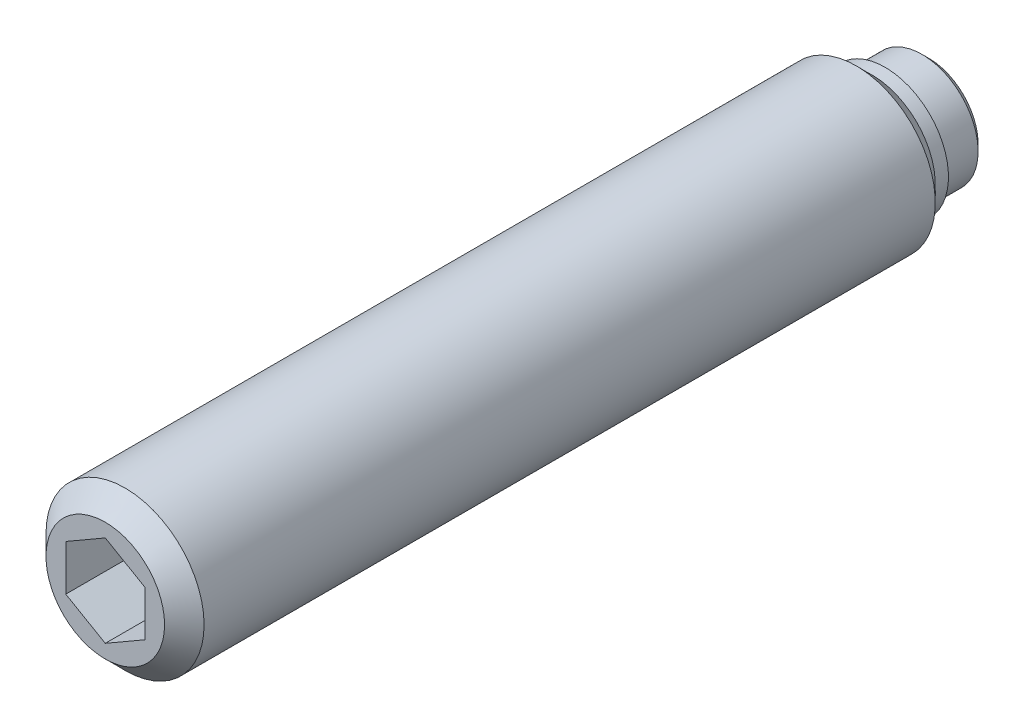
ISO-10303-21;
HEADER;
FILE_DESCRIPTION(('STEP AP214'),'2;1');
FILE_NAME('part.step','',(''),(''),'','','');
FILE_SCHEMA(('AUTOMOTIVE_DESIGN { 1 0 10303 214 1 1 1 1 }'));
ENDSEC;
DATA;
#1=APPLICATION_CONTEXT('core data for automotive mechanical design processes');
#2=APPLICATION_PROTOCOL_DEFINITION('international standard','automotive_design',2000,#1);
#3=PRODUCT_CONTEXT('',#1,'mechanical');
#4=PRODUCT('Part','Part','',(#3));
#5=PRODUCT_RELATED_PRODUCT_CATEGORY('part','',(#4));
#6=PRODUCT_DEFINITION_FORMATION('','',#4);
#7=PRODUCT_DEFINITION_CONTEXT('part definition',#1,'design');
#8=PRODUCT_DEFINITION('design','',#6,#7);
#9=PRODUCT_DEFINITION_SHAPE('','',#8);
#10=(LENGTH_UNIT() NAMED_UNIT(*) SI_UNIT(.MILLI.,.METRE.));
#11=(NAMED_UNIT(*) PLANE_ANGLE_UNIT() SI_UNIT($,.RADIAN.));
#12=(NAMED_UNIT(*) SI_UNIT($,.STERADIAN.) SOLID_ANGLE_UNIT());
#13=UNCERTAINTY_MEASURE_WITH_UNIT(LENGTH_MEASURE(1.E-05),#10,'distance_accuracy_value','');
#14=(GEOMETRIC_REPRESENTATION_CONTEXT(3) GLOBAL_UNCERTAINTY_ASSIGNED_CONTEXT((#13)) GLOBAL_UNIT_ASSIGNED_CONTEXT((#10,
#11,#12)) REPRESENTATION_CONTEXT('',''));
#15=CARTESIAN_POINT('',(0.,0.,0.));
#16=DIRECTION('',(0.,0.,1.));
#17=DIRECTION('',(1.,0.,0.));
#18=AXIS2_PLACEMENT_3D('',#15,#16,#17);
#19=CARTESIAN_POINT('',(0.,0.,3.3));
#20=DIRECTION('',(0.,0.,-1.));
#21=DIRECTION('',(-1.,0.,0.));
#22=AXIS2_PLACEMENT_3D('',#19,#20,#21);
#23=CYLINDRICAL_SURFACE('',#22,6.);
#24=CARTESIAN_POINT('',(0.,0.,5.5));
#25=DIRECTION('',(0.,0.,-1.));
#26=DIRECTION('',(-1.,0.,0.));
#27=AXIS2_PLACEMENT_3D('',#24,#25,#26);
#28=CIRCLE('',#27,6.);
#29=CARTESIAN_POINT('',(-6.,0.,5.5));
#30=VERTEX_POINT('',#29);
#31=EDGE_CURVE('E9',#30,#30,#28,.T.);
#32=ORIENTED_EDGE('',*,*,#31,.F.);
#33=EDGE_LOOP('',(#32));
#34=FACE_BOUND('',#33,.T.);
#35=CARTESIAN_POINT('',(0.,0.,61.));
#36=DIRECTION('',(0.,0.,1.));
#37=DIRECTION('',(1.,0.,0.));
#38=AXIS2_PLACEMENT_3D('',#35,#36,#37);
#39=CIRCLE('',#38,6.);
#40=CARTESIAN_POINT('',(6.,0.,61.));
#41=VERTEX_POINT('',#40);
#42=EDGE_CURVE('E123',#41,#41,#39,.T.);
#43=ORIENTED_EDGE('',*,*,#42,.F.);
#44=EDGE_LOOP('',(#43));
#45=FACE_BOUND('',#44,.T.);
#46=ADVANCED_FACE('F14',(#34,#45),#23,.T.);
#47=CARTESIAN_POINT('',(0.,0.,5.5));
#48=DIRECTION('',(0.,0.,1.));
#49=DIRECTION('',(1.,0.,0.));
#50=AXIS2_PLACEMENT_3D('',#47,#48,#49);
#51=CONICAL_SURFACE('',#50,6.,0.785398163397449);
#52=ORIENTED_EDGE('',*,*,#31,.T.);
#53=EDGE_LOOP('',(#52));
#54=FACE_BOUND('',#53,.T.);
#55=CARTESIAN_POINT('',(0.,0.,4.3));
#56=DIRECTION('',(0.,0.,-1.));
#57=DIRECTION('',(-1.,0.,0.));
#58=AXIS2_PLACEMENT_3D('',#55,#56,#57);
#59=CIRCLE('',#58,4.8);
#60=CARTESIAN_POINT('',(-4.8,0.,4.3));
#61=VERTEX_POINT('',#60);
#62=EDGE_CURVE('E21',#61,#61,#59,.T.);
#63=ORIENTED_EDGE('',*,*,#62,.F.);
#64=EDGE_LOOP('',(#63));
#65=FACE_BOUND('',#64,.T.);
#66=ADVANCED_FACE('F143',(#54,#65),#51,.T.);
#67=CARTESIAN_POINT('',(0.,0.,3.3));
#68=DIRECTION('',(0.,0.,-1.));
#69=DIRECTION('',(-1.,0.,0.));
#70=AXIS2_PLACEMENT_3D('',#67,#68,#69);
#71=CYLINDRICAL_SURFACE('',#70,4.8);
#72=ORIENTED_EDGE('',*,*,#62,.T.);
#73=EDGE_LOOP('',(#72));
#74=FACE_BOUND('',#73,.T.);
#75=CARTESIAN_POINT('',(0.,0.,3.3));
#76=DIRECTION('',(0.,0.,-1.));
#77=DIRECTION('',(-1.,0.,0.));
#78=AXIS2_PLACEMENT_3D('',#75,#76,#77);
#79=CIRCLE('',#78,4.8);
#80=CARTESIAN_POINT('',(-4.8,0.,3.3));
#81=VERTEX_POINT('',#80);
#82=EDGE_CURVE('E135',#81,#81,#79,.T.);
#83=ORIENTED_EDGE('',*,*,#82,.F.);
#84=EDGE_LOOP('',(#83));
#85=FACE_BOUND('',#84,.T.);
#86=ADVANCED_FACE('F140',(#74,#85),#71,.T.);
#87=CARTESIAN_POINT('',(0.,4.8,3.3));
#88=DIRECTION('',(0.,0.,1.));
#89=DIRECTION('',(1.,0.,0.));
#90=AXIS2_PLACEMENT_3D('',#87,#88,#89);
#91=PLANE('',#90);
#92=ORIENTED_EDGE('',*,*,#82,.T.);
#93=EDGE_LOOP('',(#92));
#94=FACE_BOUND('',#93,.T.);
#95=CARTESIAN_POINT('',(0.,0.,3.3));
#96=DIRECTION('',(0.,0.,-1.));
#97=DIRECTION('',(-1.,0.,0.));
#98=AXIS2_PLACEMENT_3D('',#95,#96,#97);
#99=CIRCLE('',#98,4.25);
#100=CARTESIAN_POINT('',(-4.25,0.,3.3));
#101=VERTEX_POINT('',#100);
#102=EDGE_CURVE('E132',#101,#101,#99,.T.);
#103=ORIENTED_EDGE('',*,*,#102,.F.);
#104=EDGE_LOOP('',(#103));
#105=FACE_BOUND('',#104,.T.);
#106=ADVANCED_FACE('F151',(#94,#105),#91,.F.);
#107=CARTESIAN_POINT('',(0.,0.,0.));
#108=DIRECTION('',(0.,0.,-1.));
#109=DIRECTION('',(-1.,0.,0.));
#110=AXIS2_PLACEMENT_3D('',#107,#108,#109);
#111=CYLINDRICAL_SURFACE('',#110,4.25);
#112=CARTESIAN_POINT('',(0.,0.,0.5));
#113=DIRECTION('',(0.,0.,-1.));
#114=DIRECTION('',(-1.,0.,0.));
#115=AXIS2_PLACEMENT_3D('',#112,#113,#114);
#116=CIRCLE('',#115,4.25);
#117=CARTESIAN_POINT('',(-4.25,0.,0.5));
#118=VERTEX_POINT('',#117);
#119=EDGE_CURVE('E129',#118,#118,#116,.T.);
#120=ORIENTED_EDGE('',*,*,#119,.F.);
#121=EDGE_LOOP('',(#120));
#122=FACE_BOUND('',#121,.T.);
#123=ORIENTED_EDGE('',*,*,#102,.T.);
#124=EDGE_LOOP('',(#123));
#125=FACE_BOUND('',#124,.T.);
#126=ADVANCED_FACE('F157',(#122,#125),#111,.T.);
#127=CARTESIAN_POINT('',(0.,0.,0.5));
#128=DIRECTION('',(0.,0.,1.));
#129=DIRECTION('',(1.,0.,0.));
#130=AXIS2_PLACEMENT_3D('',#127,#128,#129);
#131=CONICAL_SURFACE('',#130,4.25,0.785398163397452);
#132=CARTESIAN_POINT('',(0.,0.,0.));
#133=DIRECTION('',(0.,0.,-1.));
#134=DIRECTION('',(-1.,0.,0.));
#135=AXIS2_PLACEMENT_3D('',#132,#133,#134);
#136=CIRCLE('',#135,3.75);
#137=CARTESIAN_POINT('',(-3.75,0.,0.));
#138=VERTEX_POINT('',#137);
#139=EDGE_CURVE('E126',#138,#138,#136,.T.);
#140=ORIENTED_EDGE('',*,*,#139,.F.);
#141=EDGE_LOOP('',(#140));
#142=FACE_BOUND('',#141,.T.);
#143=ORIENTED_EDGE('',*,*,#119,.T.);
#144=EDGE_LOOP('',(#143));
#145=FACE_BOUND('',#144,.T.);
#146=ADVANCED_FACE('F161',(#142,#145),#131,.T.);
#147=CARTESIAN_POINT('',(0.,3.75,0.));
#148=DIRECTION('',(0.,0.,1.));
#149=DIRECTION('',(1.,0.,0.));
#150=AXIS2_PLACEMENT_3D('',#147,#148,#149);
#151=PLANE('',#150);
#152=ORIENTED_EDGE('',*,*,#139,.T.);
#153=EDGE_LOOP('',(#152));
#154=FACE_BOUND('',#153,.T.);
#155=ADVANCED_FACE('F165',(#154),#151,.F.);
#156=CARTESIAN_POINT('',(0.,0.,62.5));
#157=DIRECTION('',(0.,0.,-1.));
#158=DIRECTION('',(-1.,0.,0.));
#159=AXIS2_PLACEMENT_3D('',#156,#157,#158);
#160=CONICAL_SURFACE('',#159,4.5,0.785398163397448);
#161=ORIENTED_EDGE('',*,*,#42,.T.);
#162=EDGE_LOOP('',(#161));
#163=FACE_BOUND('',#162,.T.);
#164=CARTESIAN_POINT('',(0.,0.,62.5));
#165=DIRECTION('',(0.,0.,1.));
#166=DIRECTION('',(1.,0.,0.));
#167=AXIS2_PLACEMENT_3D('',#164,#165,#166);
#168=CIRCLE('',#167,4.5);
#169=CARTESIAN_POINT('',(4.5,0.,62.5));
#170=VERTEX_POINT('',#169);
#171=EDGE_CURVE('E115',#170,#170,#168,.T.);
#172=ORIENTED_EDGE('',*,*,#171,.F.);
#173=EDGE_LOOP('',(#172));
#174=FACE_BOUND('',#173,.T.);
#175=ADVANCED_FACE('F169',(#163,#174),#160,.T.);
#176=CARTESIAN_POINT('',(0.,-4.5,62.5));
#177=DIRECTION('',(0.,0.,1.));
#178=DIRECTION('',(1.,0.,0.));
#179=AXIS2_PLACEMENT_3D('',#176,#177,#178);
#180=PLANE('',#179);
#181=DIRECTION('',(0.866025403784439,-0.5,0.));
#182=VECTOR('',#181,1.);
#183=CARTESIAN_POINT('',(-3.,-1.73205080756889,62.5));
#184=LINE('',#183,#182);
#185=CARTESIAN_POINT('',(-3.,-1.73205080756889,62.5));
#186=VERTEX_POINT('',#185);
#187=CARTESIAN_POINT('',(0.,-3.46410161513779,62.5));
#188=VERTEX_POINT('',#187);
#189=EDGE_CURVE('E28',#186,#188,#184,.T.);
#190=ORIENTED_EDGE('',*,*,#189,.F.);
#191=DIRECTION('',(0.,-1.,0.));
#192=VECTOR('',#191,1.);
#193=CARTESIAN_POINT('',(-3.,1.73205080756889,62.5));
#194=LINE('',#193,#192);
#195=CARTESIAN_POINT('',(-3.,1.73205080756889,62.5));
#196=VERTEX_POINT('',#195);
#197=EDGE_CURVE('E111',#196,#186,#194,.T.);
#198=ORIENTED_EDGE('',*,*,#197,.F.);
#199=DIRECTION('',(-0.866025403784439,-0.5,0.));
#200=VECTOR('',#199,1.);
#201=CARTESIAN_POINT('',(0.,3.46410161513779,62.5));
#202=LINE('',#201,#200);
#203=CARTESIAN_POINT('',(0.,3.46410161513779,62.5));
#204=VERTEX_POINT('',#203);
#205=EDGE_CURVE('E109',#204,#196,#202,.T.);
#206=ORIENTED_EDGE('',*,*,#205,.F.);
#207=DIRECTION('',(-0.866025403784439,0.5,0.));
#208=VECTOR('',#207,1.);
#209=CARTESIAN_POINT('',(3.,1.73205080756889,62.5));
#210=LINE('',#209,#208);
#211=CARTESIAN_POINT('',(3.,1.73205080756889,62.5));
#212=VERTEX_POINT('',#211);
#213=EDGE_CURVE('E76',#212,#204,#210,.T.);
#214=ORIENTED_EDGE('',*,*,#213,.F.);
#215=DIRECTION('',(0.,1.,0.));
#216=VECTOR('',#215,1.);
#217=CARTESIAN_POINT('',(3.,-1.73205080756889,62.5));
#218=LINE('',#217,#216);
#219=CARTESIAN_POINT('',(3.,-1.73205080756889,62.5));
#220=VERTEX_POINT('',#219);
#221=EDGE_CURVE('E105',#220,#212,#218,.T.);
#222=ORIENTED_EDGE('',*,*,#221,.F.);
#223=DIRECTION('',(0.866025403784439,0.5,0.));
#224=VECTOR('',#223,1.);
#225=CARTESIAN_POINT('',(0.,-3.46410161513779,62.5));
#226=LINE('',#225,#224);
#227=EDGE_CURVE('E102',#188,#220,#226,.T.);
#228=ORIENTED_EDGE('',*,*,#227,.F.);
#229=EDGE_LOOP('',(#190,#198,#206,#214,#222,#228));
#230=FACE_BOUND('',#229,.T.);
#231=ORIENTED_EDGE('',*,*,#171,.T.);
#232=EDGE_LOOP('',(#231));
#233=FACE_BOUND('',#232,.T.);
#234=ADVANCED_FACE('F173',(#230,#233),#180,.T.);
#235=CARTESIAN_POINT('',(-3.,-1.73205080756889,54.5));
#236=DIRECTION('',(-0.5,-0.866025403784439,0.));
#237=DIRECTION('',(0.866025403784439,-0.5,0.));
#238=AXIS2_PLACEMENT_3D('',#235,#236,#237);
#239=PLANE('',#238);
#240=ORIENTED_EDGE('',*,*,#189,.T.);
#241=DIRECTION('',(0.,0.,1.));
#242=VECTOR('',#241,1.);
#243=CARTESIAN_POINT('',(0.,-3.46410161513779,54.5));
#244=LINE('',#243,#242);
#245=CARTESIAN_POINT('',(0.,-3.46410161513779,54.5));
#246=VERTEX_POINT('',#245);
#247=EDGE_CURVE('E58',#246,#188,#244,.T.);
#248=ORIENTED_EDGE('',*,*,#247,.F.);
#249=DIRECTION('',(0.866025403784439,-0.5,0.));
#250=VECTOR('',#249,1.);
#251=CARTESIAN_POINT('',(-3.,-1.73205080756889,54.5));
#252=LINE('',#251,#250);
#253=CARTESIAN_POINT('',(-3.,-1.73205080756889,54.5));
#254=VERTEX_POINT('',#253);
#255=EDGE_CURVE('E113',#254,#246,#252,.T.);
#256=ORIENTED_EDGE('',*,*,#255,.F.);
#257=DIRECTION('',(0.,0.,1.));
#258=VECTOR('',#257,1.);
#259=CARTESIAN_POINT('',(-3.,-1.73205080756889,54.5));
#260=LINE('',#259,#258);
#261=EDGE_CURVE('E36',#254,#186,#260,.T.);
#262=ORIENTED_EDGE('',*,*,#261,.T.);
#263=EDGE_LOOP('',(#240,#248,#256,#262));
#264=FACE_BOUND('',#263,.T.);
#265=ADVANCED_FACE('F177',(#264),#239,.F.);
#266=CARTESIAN_POINT('',(-3.,1.73205080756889,54.5));
#267=DIRECTION('',(-1.,0.,0.));
#268=DIRECTION('',(0.,0.,1.));
#269=AXIS2_PLACEMENT_3D('',#266,#267,#268);
#270=PLANE('',#269);
#271=ORIENTED_EDGE('',*,*,#197,.T.);
#272=ORIENTED_EDGE('',*,*,#261,.F.);
#273=DIRECTION('',(0.,-1.,0.));
#274=VECTOR('',#273,1.);
#275=CARTESIAN_POINT('',(-3.,1.73205080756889,54.5));
#276=LINE('',#275,#274);
#277=CARTESIAN_POINT('',(-3.,1.73205080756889,54.5));
#278=VERTEX_POINT('',#277);
#279=EDGE_CURVE('E88',#278,#254,#276,.T.);
#280=ORIENTED_EDGE('',*,*,#279,.F.);
#281=DIRECTION('',(0.,0.,1.));
#282=VECTOR('',#281,1.);
#283=CARTESIAN_POINT('',(-3.,1.73205080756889,54.5));
#284=LINE('',#283,#282);
#285=EDGE_CURVE('E80',#278,#196,#284,.T.);
#286=ORIENTED_EDGE('',*,*,#285,.T.);
#287=EDGE_LOOP('',(#271,#272,#280,#286));
#288=FACE_BOUND('',#287,.T.);
#289=ADVANCED_FACE('F181',(#288),#270,.F.);
#290=CARTESIAN_POINT('',(0.,3.46410161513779,54.5));
#291=DIRECTION('',(-0.5,0.866025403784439,0.));
#292=DIRECTION('',(-0.866025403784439,-0.5,0.));
#293=AXIS2_PLACEMENT_3D('',#290,#291,#292);
#294=PLANE('',#293);
#295=ORIENTED_EDGE('',*,*,#205,.T.);
#296=ORIENTED_EDGE('',*,*,#285,.F.);
#297=DIRECTION('',(-0.866025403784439,-0.5,0.));
#298=VECTOR('',#297,1.);
#299=CARTESIAN_POINT('',(0.,3.46410161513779,54.5));
#300=LINE('',#299,#298);
#301=CARTESIAN_POINT('',(0.,3.46410161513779,54.5));
#302=VERTEX_POINT('',#301);
#303=EDGE_CURVE('E84',#302,#278,#300,.T.);
#304=ORIENTED_EDGE('',*,*,#303,.F.);
#305=DIRECTION('',(0.,0.,1.));
#306=VECTOR('',#305,1.);
#307=CARTESIAN_POINT('',(0.,3.46410161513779,54.5));
#308=LINE('',#307,#306);
#309=EDGE_CURVE('E69',#302,#204,#308,.T.);
#310=ORIENTED_EDGE('',*,*,#309,.T.);
#311=EDGE_LOOP('',(#295,#296,#304,#310));
#312=FACE_BOUND('',#311,.T.);
#313=ADVANCED_FACE('F85',(#312),#294,.F.);
#314=CARTESIAN_POINT('',(3.,1.73205080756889,54.5));
#315=DIRECTION('',(0.5,0.866025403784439,0.));
#316=DIRECTION('',(-0.866025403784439,0.5,0.));
#317=AXIS2_PLACEMENT_3D('',#314,#315,#316);
#318=PLANE('',#317);
#319=ORIENTED_EDGE('',*,*,#213,.T.);
#320=ORIENTED_EDGE('',*,*,#309,.F.);
#321=DIRECTION('',(-0.866025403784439,0.5,0.));
#322=VECTOR('',#321,1.);
#323=CARTESIAN_POINT('',(3.,1.73205080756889,54.5));
#324=LINE('',#323,#322);
#325=CARTESIAN_POINT('',(3.,1.73205080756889,54.5));
#326=VERTEX_POINT('',#325);
#327=EDGE_CURVE('E73',#326,#302,#324,.T.);
#328=ORIENTED_EDGE('',*,*,#327,.F.);
#329=DIRECTION('',(0.,0.,1.));
#330=VECTOR('',#329,1.);
#331=CARTESIAN_POINT('',(3.,1.73205080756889,54.5));
#332=LINE('',#331,#330);
#333=EDGE_CURVE('E81',#326,#212,#332,.T.);
#334=ORIENTED_EDGE('',*,*,#333,.T.);
#335=EDGE_LOOP('',(#319,#320,#328,#334));
#336=FACE_BOUND('',#335,.T.);
#337=ADVANCED_FACE('F71',(#336),#318,.F.);
#338=CARTESIAN_POINT('',(3.,-1.73205080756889,54.5));
#339=DIRECTION('',(1.,0.,0.));
#340=DIRECTION('',(0.,0.,-1.));
#341=AXIS2_PLACEMENT_3D('',#338,#339,#340);
#342=PLANE('',#341);
#343=ORIENTED_EDGE('',*,*,#221,.T.);
#344=ORIENTED_EDGE('',*,*,#333,.F.);
#345=DIRECTION('',(0.,1.,0.));
#346=VECTOR('',#345,1.);
#347=CARTESIAN_POINT('',(3.,-1.73205080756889,54.5));
#348=LINE('',#347,#346);
#349=CARTESIAN_POINT('',(3.,-1.73205080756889,54.5));
#350=VERTEX_POINT('',#349);
#351=EDGE_CURVE('E94',#350,#326,#348,.T.);
#352=ORIENTED_EDGE('',*,*,#351,.F.);
#353=DIRECTION('',(0.,0.,1.));
#354=VECTOR('',#353,1.);
#355=CARTESIAN_POINT('',(3.,-1.73205080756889,54.5));
#356=LINE('',#355,#354);
#357=EDGE_CURVE('E118',#350,#220,#356,.T.);
#358=ORIENTED_EDGE('',*,*,#357,.T.);
#359=EDGE_LOOP('',(#343,#344,#352,#358));
#360=FACE_BOUND('',#359,.T.);
#361=ADVANCED_FACE('F185',(#360),#342,.F.);
#362=CARTESIAN_POINT('',(0.,-3.46410161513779,54.5));
#363=DIRECTION('',(0.5,-0.866025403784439,0.));
#364=DIRECTION('',(0.866025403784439,0.5,0.));
#365=AXIS2_PLACEMENT_3D('',#362,#363,#364);
#366=PLANE('',#365);
#367=ORIENTED_EDGE('',*,*,#227,.T.);
#368=ORIENTED_EDGE('',*,*,#357,.F.);
#369=DIRECTION('',(0.866025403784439,0.5,0.));
#370=VECTOR('',#369,1.);
#371=CARTESIAN_POINT('',(0.,-3.46410161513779,54.5));
#372=LINE('',#371,#370);
#373=EDGE_CURVE('E96',#246,#350,#372,.T.);
#374=ORIENTED_EDGE('',*,*,#373,.F.);
#375=ORIENTED_EDGE('',*,*,#247,.T.);
#376=EDGE_LOOP('',(#367,#368,#374,#375));
#377=FACE_BOUND('',#376,.T.);
#378=ADVANCED_FACE('F182',(#377),#366,.F.);
#379=CARTESIAN_POINT('',(0.,0.,54.5));
#380=DIRECTION('',(0.,0.,1.));
#381=DIRECTION('',(1.,0.,0.));
#382=AXIS2_PLACEMENT_3D('',#379,#380,#381);
#383=PLANE('',#382);
#384=ORIENTED_EDGE('',*,*,#255,.T.);
#385=ORIENTED_EDGE('',*,*,#373,.T.);
#386=ORIENTED_EDGE('',*,*,#351,.T.);
#387=ORIENTED_EDGE('',*,*,#327,.T.);
#388=ORIENTED_EDGE('',*,*,#303,.T.);
#389=ORIENTED_EDGE('',*,*,#279,.T.);
#390=EDGE_LOOP('',(#384,#385,#386,#387,#388,#389));
#391=FACE_BOUND('',#390,.T.);
#392=ADVANCED_FACE('F91',(#391),#383,.T.);
#393=CLOSED_SHELL('',(#46,#66,#86,#106,#126,#146,#155,#175,#234,#265,#289,#313,#337,#361,#378,#392));
#394=MANIFOLD_SOLID_BREP('B1',#393);
#395=ADVANCED_BREP_SHAPE_REPRESENTATION('',(#18,#394),#14);
#396=SHAPE_DEFINITION_REPRESENTATION(#9,#395);
ENDSEC;
END-ISO-10303-21;
